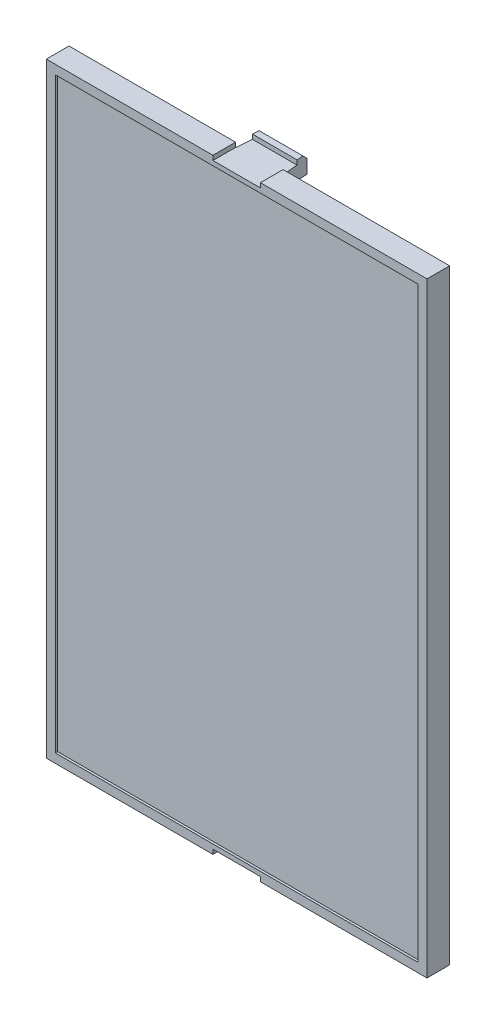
ISO-10303-21;
HEADER;
FILE_DESCRIPTION(('STEP AP214'),'2;1');
FILE_NAME('part.step','',(''),(''),'','','');
FILE_SCHEMA(('AUTOMOTIVE_DESIGN { 1 0 10303 214 1 1 1 1 }'));
ENDSEC;
DATA;
#1=APPLICATION_CONTEXT('core data for automotive mechanical design processes');
#2=APPLICATION_PROTOCOL_DEFINITION('international standard','automotive_design',2000,#1);
#3=PRODUCT_CONTEXT('',#1,'mechanical');
#4=PRODUCT('Part','Part','',(#3));
#5=PRODUCT_RELATED_PRODUCT_CATEGORY('part','',(#4));
#6=PRODUCT_DEFINITION_FORMATION('','',#4);
#7=PRODUCT_DEFINITION_CONTEXT('part definition',#1,'design');
#8=PRODUCT_DEFINITION('design','',#6,#7);
#9=PRODUCT_DEFINITION_SHAPE('','',#8);
#10=(LENGTH_UNIT() NAMED_UNIT(*) SI_UNIT(.MILLI.,.METRE.));
#11=(NAMED_UNIT(*) PLANE_ANGLE_UNIT() SI_UNIT($,.RADIAN.));
#12=(NAMED_UNIT(*) SI_UNIT($,.STERADIAN.) SOLID_ANGLE_UNIT());
#13=UNCERTAINTY_MEASURE_WITH_UNIT(LENGTH_MEASURE(1.E-05),#10,'distance_accuracy_value','');
#14=(GEOMETRIC_REPRESENTATION_CONTEXT(3) GLOBAL_UNCERTAINTY_ASSIGNED_CONTEXT((#13)) GLOBAL_UNIT_ASSIGNED_CONTEXT((#10,
#11,#12)) REPRESENTATION_CONTEXT('',''));
#15=CARTESIAN_POINT('',(0.,0.,0.));
#16=DIRECTION('',(0.,0.,1.));
#17=DIRECTION('',(1.,0.,0.));
#18=AXIS2_PLACEMENT_3D('',#15,#16,#17);
#19=CARTESIAN_POINT('',(-2.495,31.775,-3.825));
#20=DIRECTION('',(-0.996865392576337,0.,-0.0791163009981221));
#21=DIRECTION('',(-0.0791163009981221,0.,0.996865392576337));
#22=AXIS2_PLACEMENT_3D('',#19,#20,#21);
#23=PLANE('',#22);
#24=DIRECTION('',(0.,1.,0.));
#25=VECTOR('',#24,1.);
#26=CARTESIAN_POINT('',(-2.4652380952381,31.775,-4.2));
#27=LINE('',#26,#25);
#28=CARTESIAN_POINT('',(-2.46523809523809,32.9,-4.2));
#29=VERTEX_POINT('',#28);
#30=CARTESIAN_POINT('',(-2.46523809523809,33.4,-4.2));
#31=VERTEX_POINT('',#30);
#32=EDGE_CURVE('E268',#29,#31,#27,.T.);
#33=ORIENTED_EDGE('',*,*,#32,.T.);
#34=DIRECTION('',(-0.0791163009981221,0.,0.996865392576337));
#35=VECTOR('',#34,1.);
#36=CARTESIAN_POINT('',(-2.495,33.4,-3.825));
#37=LINE('',#36,#35);
#38=CARTESIAN_POINT('',(-2.40968253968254,33.4,-4.9));
#39=VERTEX_POINT('',#38);
#40=EDGE_CURVE('E262',#31,#39,#37,.F.);
#41=ORIENTED_EDGE('',*,*,#40,.T.);
#42=DIRECTION('',(0.0560314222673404,-0.70599592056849,-0.705995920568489));
#43=VECTOR('',#42,1.);
#44=CARTESIAN_POINT('',(-2.40968253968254,33.4,-4.9));
#45=LINE('',#44,#43);
#46=CARTESIAN_POINT('',(-2.37,32.9,-5.4));
#47=VERTEX_POINT('',#46);
#48=EDGE_CURVE('E20',#39,#47,#45,.T.);
#49=ORIENTED_EDGE('',*,*,#48,.T.);
#50=DIRECTION('',(0.,1.,0.));
#51=VECTOR('',#50,1.);
#52=CARTESIAN_POINT('',(-2.37,32.15,-5.4));
#53=LINE('',#52,#51);
#54=CARTESIAN_POINT('',(-2.37,31.4,-5.4));
#55=VERTEX_POINT('',#54);
#56=EDGE_CURVE('E335',#55,#47,#53,.T.);
#57=ORIENTED_EDGE('',*,*,#56,.F.);
#58=DIRECTION('',(0.0791163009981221,0.,-0.996865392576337));
#59=VECTOR('',#58,1.);
#60=CARTESIAN_POINT('',(-2.62,31.4,-2.25));
#61=LINE('',#60,#59);
#62=CARTESIAN_POINT('',(-2.62,31.4,-2.25));
#63=VERTEX_POINT('',#62);
#64=EDGE_CURVE('E344',#63,#55,#61,.T.);
#65=ORIENTED_EDGE('',*,*,#64,.F.);
#66=DIRECTION('',(0.,1.,0.));
#67=VECTOR('',#66,1.);
#68=CARTESIAN_POINT('',(-2.62,31.775,-2.25));
#69=LINE('',#68,#67);
#70=CARTESIAN_POINT('',(-2.62,32.4,-2.25));
#71=VERTEX_POINT('',#70);
#72=EDGE_CURVE('E258',#63,#71,#69,.T.);
#73=ORIENTED_EDGE('',*,*,#72,.T.);
#74=DIRECTION('',(-0.0791163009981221,0.,0.996865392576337));
#75=VECTOR('',#74,1.);
#76=CARTESIAN_POINT('',(-2.495,32.4,-3.825));
#77=LINE('',#76,#75);
#78=CARTESIAN_POINT('',(-2.60015873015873,32.4,-2.5));
#79=VERTEX_POINT('',#78);
#80=EDGE_CURVE('E287',#71,#79,#77,.F.);
#81=ORIENTED_EDGE('',*,*,#80,.T.);
#82=DIRECTION('',(0.,1.,0.));
#83=VECTOR('',#82,1.);
#84=CARTESIAN_POINT('',(-2.60015873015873,31.775,-2.5));
#85=LINE('',#84,#83);
#86=CARTESIAN_POINT('',(-2.60015873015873,32.9,-2.5));
#87=VERTEX_POINT('',#86);
#88=EDGE_CURVE('E288',#79,#87,#85,.T.);
#89=ORIENTED_EDGE('',*,*,#88,.T.);
#90=DIRECTION('',(-0.0791163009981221,0.,0.996865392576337));
#91=VECTOR('',#90,1.);
#92=CARTESIAN_POINT('',(-2.495,32.9,-3.825));
#93=LINE('',#92,#91);
#94=EDGE_CURVE('E292',#87,#29,#93,.F.);
#95=ORIENTED_EDGE('',*,*,#94,.T.);
#96=EDGE_LOOP('',(#33,#41,#49,#57,#65,#73,#81,#89,#95));
#97=FACE_BOUND('',#96,.T.);
#98=ADVANCED_FACE('F17',(#97),#23,.T.);
#99=CARTESIAN_POINT('',(2.495,32.525,-3.825));
#100=DIRECTION('',(0.996865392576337,0.,-0.079116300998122));
#101=DIRECTION('',(-0.079116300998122,0.,-0.996865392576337));
#102=AXIS2_PLACEMENT_3D('',#99,#100,#101);
#103=PLANE('',#102);
#104=DIRECTION('',(-0.079116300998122,0.,-0.996865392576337));
#105=VECTOR('',#104,1.);
#106=CARTESIAN_POINT('',(2.495,32.4,-3.825));
#107=LINE('',#106,#105);
#108=CARTESIAN_POINT('',(2.60015873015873,32.4,-2.5));
#109=VERTEX_POINT('',#108);
#110=CARTESIAN_POINT('',(2.62,32.4,-2.25));
#111=VERTEX_POINT('',#110);
#112=EDGE_CURVE('E303',#109,#111,#107,.F.);
#113=ORIENTED_EDGE('',*,*,#112,.T.);
#114=DIRECTION('',(0.,1.,0.));
#115=VECTOR('',#114,1.);
#116=CARTESIAN_POINT('',(2.62,32.525,-2.25));
#117=LINE('',#116,#115);
#118=CARTESIAN_POINT('',(2.62,31.4,-2.25));
#119=VERTEX_POINT('',#118);
#120=EDGE_CURVE('E305',#111,#119,#117,.F.);
#121=ORIENTED_EDGE('',*,*,#120,.T.);
#122=DIRECTION('',(0.0791163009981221,0.,0.996865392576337));
#123=VECTOR('',#122,1.);
#124=CARTESIAN_POINT('',(2.37,31.4,-5.4));
#125=LINE('',#124,#123);
#126=CARTESIAN_POINT('',(2.37,31.4,-5.4));
#127=VERTEX_POINT('',#126);
#128=EDGE_CURVE('E349',#127,#119,#125,.T.);
#129=ORIENTED_EDGE('',*,*,#128,.F.);
#130=DIRECTION('',(0.,1.,0.));
#131=VECTOR('',#130,1.);
#132=CARTESIAN_POINT('',(2.37,32.15,-5.4));
#133=LINE('',#132,#131);
#134=CARTESIAN_POINT('',(2.37,32.9,-5.4));
#135=VERTEX_POINT('',#134);
#136=EDGE_CURVE('E337',#135,#127,#133,.F.);
#137=ORIENTED_EDGE('',*,*,#136,.F.);
#138=DIRECTION('',(0.0560314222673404,0.70599592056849,0.705995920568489));
#139=VECTOR('',#138,1.);
#140=CARTESIAN_POINT('',(2.37,32.9,-5.4));
#141=LINE('',#140,#139);
#142=CARTESIAN_POINT('',(2.40968253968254,33.4,-4.9));
#143=VERTEX_POINT('',#142);
#144=EDGE_CURVE('E272',#135,#143,#141,.T.);
#145=ORIENTED_EDGE('',*,*,#144,.T.);
#146=DIRECTION('',(-0.079116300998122,0.,-0.996865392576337));
#147=VECTOR('',#146,1.);
#148=CARTESIAN_POINT('',(2.495,33.4,-3.825));
#149=LINE('',#148,#147);
#150=CARTESIAN_POINT('',(2.46523809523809,33.4,-4.2));
#151=VERTEX_POINT('',#150);
#152=EDGE_CURVE('E278',#143,#151,#149,.F.);
#153=ORIENTED_EDGE('',*,*,#152,.T.);
#154=DIRECTION('',(0.,1.,0.));
#155=VECTOR('',#154,1.);
#156=CARTESIAN_POINT('',(2.4652380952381,32.525,-4.2));
#157=LINE('',#156,#155);
#158=CARTESIAN_POINT('',(2.46523809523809,32.9,-4.2));
#159=VERTEX_POINT('',#158);
#160=EDGE_CURVE('E297',#151,#159,#157,.F.);
#161=ORIENTED_EDGE('',*,*,#160,.T.);
#162=DIRECTION('',(-0.079116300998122,0.,-0.996865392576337));
#163=VECTOR('',#162,1.);
#164=CARTESIAN_POINT('',(2.495,32.9,-3.825));
#165=LINE('',#164,#163);
#166=CARTESIAN_POINT('',(2.60015873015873,32.9,-2.5));
#167=VERTEX_POINT('',#166);
#168=EDGE_CURVE('E299',#159,#167,#165,.F.);
#169=ORIENTED_EDGE('',*,*,#168,.T.);
#170=DIRECTION('',(0.,1.,0.));
#171=VECTOR('',#170,1.);
#172=CARTESIAN_POINT('',(2.60015873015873,32.525,-2.5));
#173=LINE('',#172,#171);
#174=EDGE_CURVE('E301',#167,#109,#173,.F.);
#175=ORIENTED_EDGE('',*,*,#174,.T.);
#176=EDGE_LOOP('',(#113,#121,#129,#137,#145,#153,#161,#169,#175));
#177=FACE_BOUND('',#176,.T.);
#178=ADVANCED_FACE('F703',(#177),#103,.T.);
#179=CARTESIAN_POINT('',(-2.49500000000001,-32.525,-3.825));
#180=DIRECTION('',(-0.996865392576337,0.,-0.0791163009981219));
#181=DIRECTION('',(-0.0791163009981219,0.,0.996865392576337));
#182=AXIS2_PLACEMENT_3D('',#179,#180,#181);
#183=PLANE('',#182);
#184=DIRECTION('',(-0.0791163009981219,0.,0.996865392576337));
#185=VECTOR('',#184,1.);
#186=CARTESIAN_POINT('',(-2.49500000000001,-32.4,-3.825));
#187=LINE('',#186,#185);
#188=CARTESIAN_POINT('',(-2.60015873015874,-32.4,-2.5));
#189=VERTEX_POINT('',#188);
#190=CARTESIAN_POINT('',(-2.62000000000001,-32.4,-2.25));
#191=VERTEX_POINT('',#190);
#192=EDGE_CURVE('E317',#189,#191,#187,.T.);
#193=ORIENTED_EDGE('',*,*,#192,.T.);
#194=DIRECTION('',(0.,1.,0.));
#195=VECTOR('',#194,1.);
#196=CARTESIAN_POINT('',(-2.62000000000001,-32.525,-2.25));
#197=LINE('',#196,#195);
#198=CARTESIAN_POINT('',(-2.62000000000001,-31.4,-2.25));
#199=VERTEX_POINT('',#198);
#200=EDGE_CURVE('E319',#191,#199,#197,.T.);
#201=ORIENTED_EDGE('',*,*,#200,.T.);
#202=DIRECTION('',(-0.0791163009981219,0.,0.996865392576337));
#203=VECTOR('',#202,1.);
#204=CARTESIAN_POINT('',(-2.37000000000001,-31.4,-5.4));
#205=LINE('',#204,#203);
#206=CARTESIAN_POINT('',(-2.37000000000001,-31.4,-5.4));
#207=VERTEX_POINT('',#206);
#208=EDGE_CURVE('E352',#207,#199,#205,.T.);
#209=ORIENTED_EDGE('',*,*,#208,.F.);
#210=DIRECTION('',(0.,1.,0.));
#211=VECTOR('',#210,1.);
#212=CARTESIAN_POINT('',(-2.37000000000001,-32.15,-5.4));
#213=LINE('',#212,#211);
#214=CARTESIAN_POINT('',(-2.37000000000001,-32.9,-5.4));
#215=VERTEX_POINT('',#214);
#216=EDGE_CURVE('E339',#215,#207,#213,.T.);
#217=ORIENTED_EDGE('',*,*,#216,.F.);
#218=DIRECTION('',(-0.0560314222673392,-0.705995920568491,0.705995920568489));
#219=VECTOR('',#218,1.);
#220=CARTESIAN_POINT('',(-2.37000000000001,-32.9,-5.4));
#221=LINE('',#220,#219);
#222=CARTESIAN_POINT('',(-2.40968253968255,-33.4,-4.9));
#223=VERTEX_POINT('',#222);
#224=EDGE_CURVE('E307',#215,#223,#221,.T.);
#225=ORIENTED_EDGE('',*,*,#224,.T.);
#226=DIRECTION('',(-0.0791163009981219,0.,0.996865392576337));
#227=VECTOR('',#226,1.);
#228=CARTESIAN_POINT('',(-2.49500000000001,-33.4,-3.825));
#229=LINE('',#228,#227);
#230=CARTESIAN_POINT('',(-2.4652380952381,-33.4,-4.2));
#231=VERTEX_POINT('',#230);
#232=EDGE_CURVE('E309',#223,#231,#229,.T.);
#233=ORIENTED_EDGE('',*,*,#232,.T.);
#234=DIRECTION('',(0.,1.,0.));
#235=VECTOR('',#234,1.);
#236=CARTESIAN_POINT('',(-2.4652380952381,-32.525,-4.2));
#237=LINE('',#236,#235);
#238=CARTESIAN_POINT('',(-2.4652380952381,-32.9,-4.2));
#239=VERTEX_POINT('',#238);
#240=EDGE_CURVE('E311',#231,#239,#237,.T.);
#241=ORIENTED_EDGE('',*,*,#240,.T.);
#242=DIRECTION('',(-0.0791163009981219,0.,0.996865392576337));
#243=VECTOR('',#242,1.);
#244=CARTESIAN_POINT('',(-2.49500000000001,-32.9,-3.825));
#245=LINE('',#244,#243);
#246=CARTESIAN_POINT('',(-2.60015873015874,-32.9,-2.5));
#247=VERTEX_POINT('',#246);
#248=EDGE_CURVE('E313',#239,#247,#245,.T.);
#249=ORIENTED_EDGE('',*,*,#248,.T.);
#250=DIRECTION('',(0.,1.,0.));
#251=VECTOR('',#250,1.);
#252=CARTESIAN_POINT('',(-2.60015873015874,-32.525,-2.5));
#253=LINE('',#252,#251);
#254=EDGE_CURVE('E315',#247,#189,#253,.T.);
#255=ORIENTED_EDGE('',*,*,#254,.T.);
#256=EDGE_LOOP('',(#193,#201,#209,#217,#225,#233,#241,#249,#255));
#257=FACE_BOUND('',#256,.T.);
#258=ADVANCED_FACE('F700',(#257),#183,.T.);
#259=CARTESIAN_POINT('',(2.49499999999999,-31.775,-3.825));
#260=DIRECTION('',(0.996865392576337,0.,-0.079116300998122));
#261=DIRECTION('',(-0.079116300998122,0.,-0.996865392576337));
#262=AXIS2_PLACEMENT_3D('',#259,#260,#261);
#263=PLANE('',#262);
#264=DIRECTION('',(0.,1.,0.));
#265=VECTOR('',#264,1.);
#266=CARTESIAN_POINT('',(2.46523809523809,-31.775,-4.2));
#267=LINE('',#266,#265);
#268=CARTESIAN_POINT('',(2.46523809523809,-32.9,-4.2));
#269=VERTEX_POINT('',#268);
#270=CARTESIAN_POINT('',(2.46523809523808,-33.4,-4.2));
#271=VERTEX_POINT('',#270);
#272=EDGE_CURVE('E331',#269,#271,#267,.F.);
#273=ORIENTED_EDGE('',*,*,#272,.T.);
#274=DIRECTION('',(-0.079116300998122,0.,-0.996865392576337));
#275=VECTOR('',#274,1.);
#276=CARTESIAN_POINT('',(2.49499999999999,-33.4,-3.825));
#277=LINE('',#276,#275);
#278=CARTESIAN_POINT('',(2.40968253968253,-33.4,-4.9));
#279=VERTEX_POINT('',#278);
#280=EDGE_CURVE('E333',#271,#279,#277,.T.);
#281=ORIENTED_EDGE('',*,*,#280,.T.);
#282=DIRECTION('',(-0.0560314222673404,0.70599592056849,-0.705995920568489));
#283=VECTOR('',#282,1.);
#284=CARTESIAN_POINT('',(2.40968253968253,-33.4,-4.9));
#285=LINE('',#284,#283);
#286=CARTESIAN_POINT('',(2.36999999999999,-32.9,-5.4));
#287=VERTEX_POINT('',#286);
#288=EDGE_CURVE('E321',#279,#287,#285,.T.);
#289=ORIENTED_EDGE('',*,*,#288,.T.);
#290=DIRECTION('',(0.,1.,0.));
#291=VECTOR('',#290,1.);
#292=CARTESIAN_POINT('',(2.36999999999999,-32.15,-5.4));
#293=LINE('',#292,#291);
#294=CARTESIAN_POINT('',(2.36999999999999,-31.4,-5.4));
#295=VERTEX_POINT('',#294);
#296=EDGE_CURVE('E341',#295,#287,#293,.F.);
#297=ORIENTED_EDGE('',*,*,#296,.F.);
#298=DIRECTION('',(-0.0791163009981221,0.,-0.996865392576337));
#299=VECTOR('',#298,1.);
#300=CARTESIAN_POINT('',(2.61999999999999,-31.4,-2.25));
#301=LINE('',#300,#299);
#302=CARTESIAN_POINT('',(2.61999999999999,-31.4,-2.25));
#303=VERTEX_POINT('',#302);
#304=EDGE_CURVE('E355',#303,#295,#301,.T.);
#305=ORIENTED_EDGE('',*,*,#304,.F.);
#306=DIRECTION('',(0.,1.,0.));
#307=VECTOR('',#306,1.);
#308=CARTESIAN_POINT('',(2.61999999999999,-31.775,-2.25));
#309=LINE('',#308,#307);
#310=CARTESIAN_POINT('',(2.61999999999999,-32.4,-2.25));
#311=VERTEX_POINT('',#310);
#312=EDGE_CURVE('E323',#303,#311,#309,.F.);
#313=ORIENTED_EDGE('',*,*,#312,.T.);
#314=DIRECTION('',(-0.079116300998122,0.,-0.996865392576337));
#315=VECTOR('',#314,1.);
#316=CARTESIAN_POINT('',(2.49499999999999,-32.4,-3.825));
#317=LINE('',#316,#315);
#318=CARTESIAN_POINT('',(2.60015873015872,-32.4,-2.5));
#319=VERTEX_POINT('',#318);
#320=EDGE_CURVE('E325',#311,#319,#317,.T.);
#321=ORIENTED_EDGE('',*,*,#320,.T.);
#322=DIRECTION('',(0.,1.,0.));
#323=VECTOR('',#322,1.);
#324=CARTESIAN_POINT('',(2.60015873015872,-31.775,-2.5));
#325=LINE('',#324,#323);
#326=CARTESIAN_POINT('',(2.60015873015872,-32.9,-2.5));
#327=VERTEX_POINT('',#326);
#328=EDGE_CURVE('E327',#319,#327,#325,.F.);
#329=ORIENTED_EDGE('',*,*,#328,.T.);
#330=DIRECTION('',(-0.079116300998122,0.,-0.996865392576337));
#331=VECTOR('',#330,1.);
#332=CARTESIAN_POINT('',(2.49499999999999,-32.9,-3.825));
#333=LINE('',#332,#331);
#334=EDGE_CURVE('E329',#327,#269,#333,.T.);
#335=ORIENTED_EDGE('',*,*,#334,.T.);
#336=EDGE_LOOP('',(#273,#281,#289,#297,#305,#313,#321,#329,#335));
#337=FACE_BOUND('',#336,.T.);
#338=ADVANCED_FACE('F696',(#337),#263,.T.);
#339=CARTESIAN_POINT('',(0.,32.15,-5.4));
#340=DIRECTION('',(0.,0.,-1.));
#341=DIRECTION('',(-1.,0.,0.));
#342=AXIS2_PLACEMENT_3D('',#339,#340,#341);
#343=PLANE('',#342);
#344=ORIENTED_EDGE('',*,*,#136,.T.);
#345=DIRECTION('',(1.,0.,0.));
#346=VECTOR('',#345,1.);
#347=CARTESIAN_POINT('',(2.62,31.4,-5.4));
#348=LINE('',#347,#346);
#349=EDGE_CURVE('E346',#55,#127,#348,.T.);
#350=ORIENTED_EDGE('',*,*,#349,.F.);
#351=ORIENTED_EDGE('',*,*,#56,.T.);
#352=DIRECTION('',(1.,0.,0.));
#353=VECTOR('',#352,1.);
#354=CARTESIAN_POINT('',(-1.31000000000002,32.9,-5.4));
#355=LINE('',#354,#353);
#356=EDGE_CURVE('E286',#135,#47,#355,.F.);
#357=ORIENTED_EDGE('',*,*,#356,.F.);
#358=EDGE_LOOP('',(#344,#350,#351,#357));
#359=FACE_BOUND('',#358,.T.);
#360=ADVANCED_FACE('F692',(#359),#343,.T.);
#361=CARTESIAN_POINT('',(0.,-32.15,-5.4));
#362=DIRECTION('',(0.,0.,-1.));
#363=DIRECTION('',(-1.,0.,0.));
#364=AXIS2_PLACEMENT_3D('',#361,#362,#363);
#365=PLANE('',#364);
#366=ORIENTED_EDGE('',*,*,#296,.T.);
#367=DIRECTION('',(1.,0.,0.));
#368=VECTOR('',#367,1.);
#369=CARTESIAN_POINT('',(-1.31000000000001,-32.9,-5.4));
#370=LINE('',#369,#368);
#371=EDGE_CURVE('E361',#215,#287,#370,.T.);
#372=ORIENTED_EDGE('',*,*,#371,.F.);
#373=ORIENTED_EDGE('',*,*,#216,.T.);
#374=DIRECTION('',(1.,0.,0.));
#375=VECTOR('',#374,1.);
#376=CARTESIAN_POINT('',(-2.62000000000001,-31.4,-5.4));
#377=LINE('',#376,#375);
#378=EDGE_CURVE('E357',#295,#207,#377,.F.);
#379=ORIENTED_EDGE('',*,*,#378,.F.);
#380=EDGE_LOOP('',(#366,#372,#373,#379));
#381=FACE_BOUND('',#380,.T.);
#382=ADVANCED_FACE('F688',(#381),#365,.T.);
#383=CARTESIAN_POINT('',(2.62,31.4,-2.25));
#384=DIRECTION('',(0.,-1.,0.));
#385=DIRECTION('',(0.,0.,-1.));
#386=AXIS2_PLACEMENT_3D('',#383,#384,#385);
#387=PLANE('',#386);
#388=ORIENTED_EDGE('',*,*,#128,.T.);
#389=DIRECTION('',(1.,0.,0.));
#390=VECTOR('',#389,1.);
#391=CARTESIAN_POINT('',(0.,31.4,-2.25));
#392=LINE('',#391,#390);
#393=EDGE_CURVE('E364',#119,#63,#392,.F.);
#394=ORIENTED_EDGE('',*,*,#393,.T.);
#395=ORIENTED_EDGE('',*,*,#64,.T.);
#396=ORIENTED_EDGE('',*,*,#349,.T.);
#397=EDGE_LOOP('',(#388,#394,#395,#396));
#398=FACE_BOUND('',#397,.T.);
#399=ADVANCED_FACE('F684',(#398),#387,.T.);
#400=CARTESIAN_POINT('',(-2.62000000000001,-31.4,-2.25));
#401=DIRECTION('',(0.,1.,0.));
#402=DIRECTION('',(0.,0.,1.));
#403=AXIS2_PLACEMENT_3D('',#400,#401,#402);
#404=PLANE('',#403);
#405=ORIENTED_EDGE('',*,*,#304,.T.);
#406=ORIENTED_EDGE('',*,*,#378,.T.);
#407=ORIENTED_EDGE('',*,*,#208,.T.);
#408=DIRECTION('',(1.,0.,0.));
#409=VECTOR('',#408,1.);
#410=CARTESIAN_POINT('',(0.,-31.4,-2.25));
#411=LINE('',#410,#409);
#412=EDGE_CURVE('E281',#199,#303,#411,.T.);
#413=ORIENTED_EDGE('',*,*,#412,.T.);
#414=EDGE_LOOP('',(#405,#406,#407,#413));
#415=FACE_BOUND('',#414,.T.);
#416=ADVANCED_FACE('F681',(#415),#404,.T.);
#417=CARTESIAN_POINT('',(-1.31000000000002,33.15,-5.15));
#418=DIRECTION('',(0.,0.707106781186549,-0.707106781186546));
#419=DIRECTION('',(0.,0.707106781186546,0.707106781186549));
#420=AXIS2_PLACEMENT_3D('',#417,#418,#419);
#421=PLANE('',#420);
#422=ORIENTED_EDGE('',*,*,#144,.F.);
#423=ORIENTED_EDGE('',*,*,#356,.T.);
#424=ORIENTED_EDGE('',*,*,#48,.F.);
#425=DIRECTION('',(-1.,0.,0.));
#426=VECTOR('',#425,1.);
#427=CARTESIAN_POINT('',(-2.62000000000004,33.4,-4.9));
#428=LINE('',#427,#426);
#429=EDGE_CURVE('E276',#143,#39,#428,.T.);
#430=ORIENTED_EDGE('',*,*,#429,.F.);
#431=EDGE_LOOP('',(#422,#423,#424,#430));
#432=FACE_BOUND('',#431,.T.);
#433=ADVANCED_FACE('F284',(#432),#421,.T.);
#434=CARTESIAN_POINT('',(-1.31000000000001,-33.15,-5.15));
#435=DIRECTION('',(0.,-0.707106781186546,-0.707106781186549));
#436=DIRECTION('',(0.,0.707106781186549,-0.707106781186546));
#437=AXIS2_PLACEMENT_3D('',#434,#435,#436);
#438=PLANE('',#437);
#439=ORIENTED_EDGE('',*,*,#288,.F.);
#440=DIRECTION('',(1.,0.,0.));
#441=VECTOR('',#440,1.);
#442=CARTESIAN_POINT('',(-2.62000000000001,-33.4,-4.9));
#443=LINE('',#442,#441);
#444=EDGE_CURVE('E382',#223,#279,#443,.T.);
#445=ORIENTED_EDGE('',*,*,#444,.F.);
#446=ORIENTED_EDGE('',*,*,#224,.F.);
#447=ORIENTED_EDGE('',*,*,#371,.T.);
#448=EDGE_LOOP('',(#439,#445,#446,#447));
#449=FACE_BOUND('',#448,.T.);
#450=ADVANCED_FACE('F674',(#449),#438,.T.);
#451=CARTESIAN_POINT('',(0.,0.,-2.25));
#452=DIRECTION('',(0.,0.,1.));
#453=DIRECTION('',(1.,0.,0.));
#454=AXIS2_PLACEMENT_3D('',#451,#452,#453);
#455=PLANE('',#454);
#456=DIRECTION('',(1.,0.,0.));
#457=VECTOR('',#456,1.);
#458=CARTESIAN_POINT('',(20.,32.4,-2.25));
#459=LINE('',#458,#457);
#460=CARTESIAN_POINT('',(20.,32.4,-2.25));
#461=VERTEX_POINT('',#460);
#462=EDGE_CURVE('E394',#111,#461,#459,.T.);
#463=ORIENTED_EDGE('',*,*,#462,.T.);
#464=DIRECTION('',(0.,1.,0.));
#465=VECTOR('',#464,1.);
#466=CARTESIAN_POINT('',(20.,-38.65,-2.25));
#467=LINE('',#466,#465);
#468=CARTESIAN_POINT('',(20.,-32.4,-2.25));
#469=VERTEX_POINT('',#468);
#470=EDGE_CURVE('E388',#461,#469,#467,.F.);
#471=ORIENTED_EDGE('',*,*,#470,.T.);
#472=DIRECTION('',(1.,0.,0.));
#473=VECTOR('',#472,1.);
#474=CARTESIAN_POINT('',(-20.,-32.4,-2.25));
#475=LINE('',#474,#473);
#476=EDGE_CURVE('E385',#469,#311,#475,.F.);
#477=ORIENTED_EDGE('',*,*,#476,.T.);
#478=ORIENTED_EDGE('',*,*,#312,.F.);
#479=ORIENTED_EDGE('',*,*,#412,.F.);
#480=ORIENTED_EDGE('',*,*,#200,.F.);
#481=DIRECTION('',(1.,0.,0.));
#482=VECTOR('',#481,1.);
#483=CARTESIAN_POINT('',(-20.,-32.4,-2.25));
#484=LINE('',#483,#482);
#485=CARTESIAN_POINT('',(-20.,-32.4,-2.25));
#486=VERTEX_POINT('',#485);
#487=EDGE_CURVE('E376',#191,#486,#484,.F.);
#488=ORIENTED_EDGE('',*,*,#487,.T.);
#489=DIRECTION('',(0.,1.,0.));
#490=VECTOR('',#489,1.);
#491=CARTESIAN_POINT('',(-20.,38.65,-2.25));
#492=LINE('',#491,#490);
#493=CARTESIAN_POINT('',(-20.,32.4,-2.25));
#494=VERTEX_POINT('',#493);
#495=EDGE_CURVE('E370',#486,#494,#492,.T.);
#496=ORIENTED_EDGE('',*,*,#495,.T.);
#497=DIRECTION('',(1.,0.,0.));
#498=VECTOR('',#497,1.);
#499=CARTESIAN_POINT('',(20.,32.4,-2.25));
#500=LINE('',#499,#498);
#501=EDGE_CURVE('E280',#494,#71,#500,.T.);
#502=ORIENTED_EDGE('',*,*,#501,.T.);
#503=ORIENTED_EDGE('',*,*,#72,.F.);
#504=ORIENTED_EDGE('',*,*,#393,.F.);
#505=ORIENTED_EDGE('',*,*,#120,.F.);
#506=EDGE_LOOP('',(#463,#471,#477,#478,#479,#480,#488,#496,#502,#503,#504,#505));
#507=FACE_BOUND('',#506,.T.);
#508=ADVANCED_FACE('F671',(#507),#455,.F.);
#509=CARTESIAN_POINT('',(-2.62000000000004,33.4,-5.4));
#510=DIRECTION('',(0.,1.,0.));
#511=DIRECTION('',(-1.,0.,0.));
#512=AXIS2_PLACEMENT_3D('',#509,#510,#511);
#513=PLANE('',#512);
#514=ORIENTED_EDGE('',*,*,#152,.F.);
#515=ORIENTED_EDGE('',*,*,#429,.T.);
#516=ORIENTED_EDGE('',*,*,#40,.F.);
#517=DIRECTION('',(1.,0.,0.));
#518=VECTOR('',#517,1.);
#519=CARTESIAN_POINT('',(-2.62000000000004,33.4,-4.2));
#520=LINE('',#519,#518);
#521=EDGE_CURVE('E402',#151,#31,#520,.F.);
#522=ORIENTED_EDGE('',*,*,#521,.F.);
#523=EDGE_LOOP('',(#514,#515,#516,#522));
#524=FACE_BOUND('',#523,.T.);
#525=ADVANCED_FACE('F277',(#524),#513,.T.);
#526=CARTESIAN_POINT('',(20.,32.4,-2.5));
#527=DIRECTION('',(0.,1.,0.));
#528=DIRECTION('',(0.,0.,1.));
#529=AXIS2_PLACEMENT_3D('',#526,#527,#528);
#530=PLANE('',#529);
#531=DIRECTION('',(0.,0.,1.));
#532=VECTOR('',#531,1.);
#533=CARTESIAN_POINT('',(-20.,32.4,-2.5));
#534=LINE('',#533,#532);
#535=CARTESIAN_POINT('',(-20.,32.4,-2.5));
#536=VERTEX_POINT('',#535);
#537=EDGE_CURVE('E373',#494,#536,#534,.F.);
#538=ORIENTED_EDGE('',*,*,#537,.T.);
#539=DIRECTION('',(-1.,0.,0.));
#540=VECTOR('',#539,1.);
#541=CARTESIAN_POINT('',(0.,32.4,-2.5));
#542=LINE('',#541,#540);
#543=EDGE_CURVE('E406',#79,#536,#542,.T.);
#544=ORIENTED_EDGE('',*,*,#543,.F.);
#545=ORIENTED_EDGE('',*,*,#80,.F.);
#546=ORIENTED_EDGE('',*,*,#501,.F.);
#547=EDGE_LOOP('',(#538,#544,#545,#546));
#548=FACE_BOUND('',#547,.T.);
#549=ADVANCED_FACE('F664',(#548),#530,.F.);
#550=CARTESIAN_POINT('',(-20.,38.65,-2.5));
#551=DIRECTION('',(-1.,0.,0.));
#552=DIRECTION('',(0.,0.,1.));
#553=AXIS2_PLACEMENT_3D('',#550,#551,#552);
#554=PLANE('',#553);
#555=ORIENTED_EDGE('',*,*,#537,.F.);
#556=ORIENTED_EDGE('',*,*,#495,.F.);
#557=DIRECTION('',(0.,0.,-1.));
#558=VECTOR('',#557,1.);
#559=CARTESIAN_POINT('',(-20.,-32.4,-2.5));
#560=LINE('',#559,#558);
#561=CARTESIAN_POINT('',(-20.,-32.4,-2.5));
#562=VERTEX_POINT('',#561);
#563=EDGE_CURVE('E379',#486,#562,#560,.T.);
#564=ORIENTED_EDGE('',*,*,#563,.T.);
#565=DIRECTION('',(0.,1.,0.));
#566=VECTOR('',#565,1.);
#567=CARTESIAN_POINT('',(-20.,0.,-2.5));
#568=LINE('',#567,#566);
#569=EDGE_CURVE('E408',#536,#562,#568,.F.);
#570=ORIENTED_EDGE('',*,*,#569,.F.);
#571=EDGE_LOOP('',(#555,#556,#564,#570));
#572=FACE_BOUND('',#571,.T.);
#573=ADVANCED_FACE('F660',(#572),#554,.F.);
#574=CARTESIAN_POINT('',(-20.,-32.4,-2.5));
#575=DIRECTION('',(0.,-1.,0.));
#576=DIRECTION('',(0.,0.,-1.));
#577=AXIS2_PLACEMENT_3D('',#574,#575,#576);
#578=PLANE('',#577);
#579=ORIENTED_EDGE('',*,*,#563,.F.);
#580=ORIENTED_EDGE('',*,*,#487,.F.);
#581=ORIENTED_EDGE('',*,*,#192,.F.);
#582=DIRECTION('',(-1.,0.,0.));
#583=VECTOR('',#582,1.);
#584=CARTESIAN_POINT('',(0.,-32.4,-2.5));
#585=LINE('',#584,#583);
#586=EDGE_CURVE('E410',#562,#189,#585,.F.);
#587=ORIENTED_EDGE('',*,*,#586,.F.);
#588=EDGE_LOOP('',(#579,#580,#581,#587));
#589=FACE_BOUND('',#588,.T.);
#590=ADVANCED_FACE('F656',(#589),#578,.F.);
#591=CARTESIAN_POINT('',(-2.62000000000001,-33.4,-4.2));
#592=DIRECTION('',(0.,-1.,0.));
#593=DIRECTION('',(1.,0.,0.));
#594=AXIS2_PLACEMENT_3D('',#591,#592,#593);
#595=PLANE('',#594);
#596=ORIENTED_EDGE('',*,*,#280,.F.);
#597=DIRECTION('',(1.,0.,0.));
#598=VECTOR('',#597,1.);
#599=CARTESIAN_POINT('',(-2.62000000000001,-33.4,-4.2));
#600=LINE('',#599,#598);
#601=EDGE_CURVE('E417',#231,#271,#600,.T.);
#602=ORIENTED_EDGE('',*,*,#601,.F.);
#603=ORIENTED_EDGE('',*,*,#232,.F.);
#604=ORIENTED_EDGE('',*,*,#444,.T.);
#605=EDGE_LOOP('',(#596,#602,#603,#604));
#606=FACE_BOUND('',#605,.T.);
#607=ADVANCED_FACE('F652',(#606),#595,.T.);
#608=CARTESIAN_POINT('',(-20.,-32.4,-2.5));
#609=DIRECTION('',(0.,-1.,0.));
#610=DIRECTION('',(0.,0.,-1.));
#611=AXIS2_PLACEMENT_3D('',#608,#609,#610);
#612=PLANE('',#611);
#613=DIRECTION('',(0.,0.,-1.));
#614=VECTOR('',#613,1.);
#615=CARTESIAN_POINT('',(20.,-32.4,-2.5));
#616=LINE('',#615,#614);
#617=CARTESIAN_POINT('',(20.,-32.4,-2.5));
#618=VERTEX_POINT('',#617);
#619=EDGE_CURVE('E391',#469,#618,#616,.T.);
#620=ORIENTED_EDGE('',*,*,#619,.T.);
#621=DIRECTION('',(-1.,0.,0.));
#622=VECTOR('',#621,1.);
#623=CARTESIAN_POINT('',(0.,-32.4,-2.5));
#624=LINE('',#623,#622);
#625=EDGE_CURVE('E431',#319,#618,#624,.F.);
#626=ORIENTED_EDGE('',*,*,#625,.F.);
#627=ORIENTED_EDGE('',*,*,#320,.F.);
#628=ORIENTED_EDGE('',*,*,#476,.F.);
#629=EDGE_LOOP('',(#620,#626,#627,#628));
#630=FACE_BOUND('',#629,.T.);
#631=ADVANCED_FACE('F648',(#630),#612,.F.);
#632=CARTESIAN_POINT('',(20.,-38.65,-2.5));
#633=DIRECTION('',(1.,0.,0.));
#634=DIRECTION('',(0.,0.,-1.));
#635=AXIS2_PLACEMENT_3D('',#632,#633,#634);
#636=PLANE('',#635);
#637=ORIENTED_EDGE('',*,*,#619,.F.);
#638=ORIENTED_EDGE('',*,*,#470,.F.);
#639=DIRECTION('',(0.,0.,1.));
#640=VECTOR('',#639,1.);
#641=CARTESIAN_POINT('',(20.,32.4,-2.5));
#642=LINE('',#641,#640);
#643=CARTESIAN_POINT('',(20.,32.4,-2.5));
#644=VERTEX_POINT('',#643);
#645=EDGE_CURVE('E397',#461,#644,#642,.F.);
#646=ORIENTED_EDGE('',*,*,#645,.T.);
#647=DIRECTION('',(0.,1.,0.));
#648=VECTOR('',#647,1.);
#649=CARTESIAN_POINT('',(20.,0.,-2.5));
#650=LINE('',#649,#648);
#651=EDGE_CURVE('E433',#618,#644,#650,.T.);
#652=ORIENTED_EDGE('',*,*,#651,.F.);
#653=EDGE_LOOP('',(#637,#638,#646,#652));
#654=FACE_BOUND('',#653,.T.);
#655=ADVANCED_FACE('F644',(#654),#636,.F.);
#656=CARTESIAN_POINT('',(20.,32.4,-2.5));
#657=DIRECTION('',(0.,1.,0.));
#658=DIRECTION('',(0.,0.,1.));
#659=AXIS2_PLACEMENT_3D('',#656,#657,#658);
#660=PLANE('',#659);
#661=ORIENTED_EDGE('',*,*,#645,.F.);
#662=ORIENTED_EDGE('',*,*,#462,.F.);
#663=ORIENTED_EDGE('',*,*,#112,.F.);
#664=DIRECTION('',(-1.,0.,0.));
#665=VECTOR('',#664,1.);
#666=CARTESIAN_POINT('',(0.,32.4,-2.5));
#667=LINE('',#666,#665);
#668=EDGE_CURVE('E435',#644,#109,#667,.T.);
#669=ORIENTED_EDGE('',*,*,#668,.F.);
#670=EDGE_LOOP('',(#661,#662,#663,#669));
#671=FACE_BOUND('',#670,.T.);
#672=ADVANCED_FACE('F640',(#671),#660,.F.);
#673=CARTESIAN_POINT('',(2.62,32.9,0.));
#674=DIRECTION('',(-1.,0.,0.));
#675=DIRECTION('',(0.,0.,1.));
#676=AXIS2_PLACEMENT_3D('',#673,#674,#675);
#677=PLANE('',#676);
#678=DIRECTION('',(0.,1.,0.));
#679=VECTOR('',#678,1.);
#680=CARTESIAN_POINT('',(2.62,0.,-2.5));
#681=LINE('',#680,#679);
#682=CARTESIAN_POINT('',(2.62,32.9,-2.5));
#683=VERTEX_POINT('',#682);
#684=CARTESIAN_POINT('',(2.62,33.4,-2.5));
#685=VERTEX_POINT('',#684);
#686=EDGE_CURVE('E427',#683,#685,#681,.T.);
#687=ORIENTED_EDGE('',*,*,#686,.F.);
#688=DIRECTION('',(0.,0.,1.));
#689=VECTOR('',#688,1.);
#690=CARTESIAN_POINT('',(2.62,32.9,0.));
#691=LINE('',#690,#689);
#692=CARTESIAN_POINT('',(2.62,32.9,0.));
#693=VERTEX_POINT('',#692);
#694=EDGE_CURVE('E450',#693,#683,#691,.F.);
#695=ORIENTED_EDGE('',*,*,#694,.F.);
#696=DIRECTION('',(0.,1.,0.));
#697=VECTOR('',#696,1.);
#698=CARTESIAN_POINT('',(2.62,32.9,0.));
#699=LINE('',#698,#697);
#700=CARTESIAN_POINT('',(2.62,33.4,0.));
#701=VERTEX_POINT('',#700);
#702=EDGE_CURVE('E400',#693,#701,#699,.T.);
#703=ORIENTED_EDGE('',*,*,#702,.T.);
#704=DIRECTION('',(0.,0.,1.));
#705=VECTOR('',#704,1.);
#706=CARTESIAN_POINT('',(2.62,33.4,0.));
#707=LINE('',#706,#705);
#708=EDGE_CURVE('E441',#685,#701,#707,.T.);
#709=ORIENTED_EDGE('',*,*,#708,.F.);
#710=EDGE_LOOP('',(#687,#695,#703,#709));
#711=FACE_BOUND('',#710,.T.);
#712=ADVANCED_FACE('F636',(#711),#677,.T.);
#713=CARTESIAN_POINT('',(-2.62000000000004,33.4,-4.2));
#714=DIRECTION('',(0.,0.,1.));
#715=DIRECTION('',(1.,0.,0.));
#716=AXIS2_PLACEMENT_3D('',#713,#714,#715);
#717=PLANE('',#716);
#718=ORIENTED_EDGE('',*,*,#160,.F.);
#719=ORIENTED_EDGE('',*,*,#521,.T.);
#720=ORIENTED_EDGE('',*,*,#32,.F.);
#721=DIRECTION('',(1.,0.,0.));
#722=VECTOR('',#721,1.);
#723=CARTESIAN_POINT('',(-2.62,32.9,-4.2));
#724=LINE('',#723,#722);
#725=EDGE_CURVE('E455',#159,#29,#724,.F.);
#726=ORIENTED_EDGE('',*,*,#725,.F.);
#727=EDGE_LOOP('',(#718,#719,#720,#726));
#728=FACE_BOUND('',#727,.T.);
#729=ADVANCED_FACE('F632',(#728),#717,.T.);
#730=CARTESIAN_POINT('',(-2.62,33.4,0.));
#731=DIRECTION('',(1.,0.,0.));
#732=DIRECTION('',(0.,0.,-1.));
#733=AXIS2_PLACEMENT_3D('',#730,#731,#732);
#734=PLANE('',#733);
#735=DIRECTION('',(0.,1.,0.));
#736=VECTOR('',#735,1.);
#737=CARTESIAN_POINT('',(-2.62,0.,-2.5));
#738=LINE('',#737,#736);
#739=CARTESIAN_POINT('',(-2.62,33.4,-2.5));
#740=VERTEX_POINT('',#739);
#741=CARTESIAN_POINT('',(-2.62,32.9,-2.5));
#742=VERTEX_POINT('',#741);
#743=EDGE_CURVE('E415',#740,#742,#738,.F.);
#744=ORIENTED_EDGE('',*,*,#743,.F.);
#745=DIRECTION('',(0.,0.,1.));
#746=VECTOR('',#745,1.);
#747=CARTESIAN_POINT('',(-2.62,33.4,0.));
#748=LINE('',#747,#746);
#749=CARTESIAN_POINT('',(-2.62,33.4,0.));
#750=VERTEX_POINT('',#749);
#751=EDGE_CURVE('E458',#750,#740,#748,.F.);
#752=ORIENTED_EDGE('',*,*,#751,.F.);
#753=DIRECTION('',(0.,1.,0.));
#754=VECTOR('',#753,1.);
#755=CARTESIAN_POINT('',(-2.62,33.4,0.));
#756=LINE('',#755,#754);
#757=CARTESIAN_POINT('',(-2.62,32.9,0.));
#758=VERTEX_POINT('',#757);
#759=EDGE_CURVE('E404',#750,#758,#756,.F.);
#760=ORIENTED_EDGE('',*,*,#759,.T.);
#761=DIRECTION('',(0.,0.,1.));
#762=VECTOR('',#761,1.);
#763=CARTESIAN_POINT('',(-2.62,32.9,0.));
#764=LINE('',#763,#762);
#765=EDGE_CURVE('E447',#742,#758,#764,.T.);
#766=ORIENTED_EDGE('',*,*,#765,.F.);
#767=EDGE_LOOP('',(#744,#752,#760,#766));
#768=FACE_BOUND('',#767,.T.);
#769=ADVANCED_FACE('F628',(#768),#734,.T.);
#770=CARTESIAN_POINT('',(0.,0.,-2.5));
#771=DIRECTION('',(0.,0.,-1.));
#772=DIRECTION('',(-1.,0.,0.));
#773=AXIS2_PLACEMENT_3D('',#770,#771,#772);
#774=PLANE('',#773);
#775=DIRECTION('',(1.,0.,0.));
#776=VECTOR('',#775,1.);
#777=CARTESIAN_POINT('',(-2.62,32.9,-2.5));
#778=LINE('',#777,#776);
#779=EDGE_CURVE('E444',#87,#742,#778,.F.);
#780=ORIENTED_EDGE('',*,*,#779,.F.);
#781=ORIENTED_EDGE('',*,*,#88,.F.);
#782=ORIENTED_EDGE('',*,*,#543,.T.);
#783=ORIENTED_EDGE('',*,*,#569,.T.);
#784=ORIENTED_EDGE('',*,*,#586,.T.);
#785=ORIENTED_EDGE('',*,*,#254,.F.);
#786=DIRECTION('',(-1.,0.,0.));
#787=VECTOR('',#786,1.);
#788=CARTESIAN_POINT('',(0.,-32.9,-2.5));
#789=LINE('',#788,#787);
#790=CARTESIAN_POINT('',(-2.62,-32.9,-2.5));
#791=VERTEX_POINT('',#790);
#792=EDGE_CURVE('E413',#247,#791,#789,.T.);
#793=ORIENTED_EDGE('',*,*,#792,.T.);
#794=DIRECTION('',(0.,1.,0.));
#795=VECTOR('',#794,1.);
#796=CARTESIAN_POINT('',(-2.62,-32.9,-2.5));
#797=LINE('',#796,#795);
#798=CARTESIAN_POINT('',(-2.62,-33.4,-2.5));
#799=VERTEX_POINT('',#798);
#800=EDGE_CURVE('E422',#799,#791,#797,.T.);
#801=ORIENTED_EDGE('',*,*,#800,.F.);
#802=DIRECTION('',(1.,0.,0.));
#803=VECTOR('',#802,1.);
#804=CARTESIAN_POINT('',(-2.62,-33.4,-2.5));
#805=LINE('',#804,#803);
#806=CARTESIAN_POINT('',(-21.,-33.4,-2.5));
#807=VERTEX_POINT('',#806);
#808=EDGE_CURVE('E470',#807,#799,#805,.T.);
#809=ORIENTED_EDGE('',*,*,#808,.F.);
#810=DIRECTION('',(0.,1.,0.));
#811=VECTOR('',#810,1.);
#812=CARTESIAN_POINT('',(-21.,-39.65,-2.5));
#813=LINE('',#812,#811);
#814=CARTESIAN_POINT('',(-21.,33.4,-2.5));
#815=VERTEX_POINT('',#814);
#816=EDGE_CURVE('E465',#815,#807,#813,.F.);
#817=ORIENTED_EDGE('',*,*,#816,.F.);
#818=DIRECTION('',(1.,0.,0.));
#819=VECTOR('',#818,1.);
#820=CARTESIAN_POINT('',(-21.,33.4,-2.5));
#821=LINE('',#820,#819);
#822=EDGE_CURVE('E460',#740,#815,#821,.F.);
#823=ORIENTED_EDGE('',*,*,#822,.F.);
#824=ORIENTED_EDGE('',*,*,#743,.T.);
#825=EDGE_LOOP('',(#780,#781,#782,#783,#784,#785,#793,#801,#809,#817,#823,#824));
#826=FACE_BOUND('',#825,.T.);
#827=ADVANCED_FACE('F624',(#826),#774,.T.);
#828=CARTESIAN_POINT('',(-2.62000000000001,-32.9,-4.2));
#829=DIRECTION('',(0.,0.,1.));
#830=DIRECTION('',(1.,0.,0.));
#831=AXIS2_PLACEMENT_3D('',#828,#829,#830);
#832=PLANE('',#831);
#833=ORIENTED_EDGE('',*,*,#272,.F.);
#834=DIRECTION('',(1.,0.,0.));
#835=VECTOR('',#834,1.);
#836=CARTESIAN_POINT('',(2.62,-32.9,-4.2));
#837=LINE('',#836,#835);
#838=EDGE_CURVE('E475',#239,#269,#837,.T.);
#839=ORIENTED_EDGE('',*,*,#838,.F.);
#840=ORIENTED_EDGE('',*,*,#240,.F.);
#841=ORIENTED_EDGE('',*,*,#601,.T.);
#842=EDGE_LOOP('',(#833,#839,#840,#841));
#843=FACE_BOUND('',#842,.T.);
#844=ADVANCED_FACE('F620',(#843),#832,.T.);
#845=CARTESIAN_POINT('',(-2.62,-32.9,0.));
#846=DIRECTION('',(1.,0.,0.));
#847=DIRECTION('',(0.,0.,-1.));
#848=AXIS2_PLACEMENT_3D('',#845,#846,#847);
#849=PLANE('',#848);
#850=ORIENTED_EDGE('',*,*,#800,.T.);
#851=DIRECTION('',(0.,0.,-1.));
#852=VECTOR('',#851,1.);
#853=CARTESIAN_POINT('',(-2.62,-32.9,0.));
#854=LINE('',#853,#852);
#855=CARTESIAN_POINT('',(-2.62,-32.9,0.));
#856=VERTEX_POINT('',#855);
#857=EDGE_CURVE('E484',#856,#791,#854,.T.);
#858=ORIENTED_EDGE('',*,*,#857,.F.);
#859=DIRECTION('',(0.,1.,0.));
#860=VECTOR('',#859,1.);
#861=CARTESIAN_POINT('',(-2.62,-32.9,0.));
#862=LINE('',#861,#860);
#863=CARTESIAN_POINT('',(-2.62,-33.4,0.));
#864=VERTEX_POINT('',#863);
#865=EDGE_CURVE('E420',#856,#864,#862,.F.);
#866=ORIENTED_EDGE('',*,*,#865,.T.);
#867=DIRECTION('',(0.,0.,1.));
#868=VECTOR('',#867,1.);
#869=CARTESIAN_POINT('',(-2.62,-33.4,0.));
#870=LINE('',#869,#868);
#871=EDGE_CURVE('E472',#799,#864,#870,.T.);
#872=ORIENTED_EDGE('',*,*,#871,.F.);
#873=EDGE_LOOP('',(#850,#858,#866,#872));
#874=FACE_BOUND('',#873,.T.);
#875=ADVANCED_FACE('F616',(#874),#849,.T.);
#876=CARTESIAN_POINT('',(2.62,-33.4,0.));
#877=DIRECTION('',(-1.,0.,0.));
#878=DIRECTION('',(0.,0.,1.));
#879=AXIS2_PLACEMENT_3D('',#876,#877,#878);
#880=PLANE('',#879);
#881=DIRECTION('',(0.,1.,0.));
#882=VECTOR('',#881,1.);
#883=CARTESIAN_POINT('',(2.62,0.,-2.5));
#884=LINE('',#883,#882);
#885=CARTESIAN_POINT('',(2.62,-33.4,-2.5));
#886=VERTEX_POINT('',#885);
#887=CARTESIAN_POINT('',(2.62,-32.9,-2.5));
#888=VERTEX_POINT('',#887);
#889=EDGE_CURVE('E429',#886,#888,#884,.T.);
#890=ORIENTED_EDGE('',*,*,#889,.F.);
#891=DIRECTION('',(0.,0.,-1.));
#892=VECTOR('',#891,1.);
#893=CARTESIAN_POINT('',(2.62,-33.4,0.));
#894=LINE('',#893,#892);
#895=CARTESIAN_POINT('',(2.62,-33.4,0.));
#896=VERTEX_POINT('',#895);
#897=EDGE_CURVE('E487',#896,#886,#894,.T.);
#898=ORIENTED_EDGE('',*,*,#897,.F.);
#899=DIRECTION('',(0.,1.,0.));
#900=VECTOR('',#899,1.);
#901=CARTESIAN_POINT('',(2.62,-33.4,0.));
#902=LINE('',#901,#900);
#903=CARTESIAN_POINT('',(2.62,-32.9,0.));
#904=VERTEX_POINT('',#903);
#905=EDGE_CURVE('E425',#896,#904,#902,.T.);
#906=ORIENTED_EDGE('',*,*,#905,.T.);
#907=DIRECTION('',(0.,0.,-1.));
#908=VECTOR('',#907,1.);
#909=CARTESIAN_POINT('',(2.62,-32.9,0.));
#910=LINE('',#909,#908);
#911=EDGE_CURVE('E481',#888,#904,#910,.F.);
#912=ORIENTED_EDGE('',*,*,#911,.F.);
#913=EDGE_LOOP('',(#890,#898,#906,#912));
#914=FACE_BOUND('',#913,.T.);
#915=ADVANCED_FACE('F612',(#914),#880,.T.);
#916=CARTESIAN_POINT('',(0.,0.,-2.5));
#917=DIRECTION('',(0.,0.,-1.));
#918=DIRECTION('',(-1.,0.,0.));
#919=AXIS2_PLACEMENT_3D('',#916,#917,#918);
#920=PLANE('',#919);
#921=ORIENTED_EDGE('',*,*,#174,.F.);
#922=DIRECTION('',(1.,0.,0.));
#923=VECTOR('',#922,1.);
#924=CARTESIAN_POINT('',(-2.62,32.9,-2.5));
#925=LINE('',#924,#923);
#926=EDGE_CURVE('E452',#683,#167,#925,.F.);
#927=ORIENTED_EDGE('',*,*,#926,.F.);
#928=ORIENTED_EDGE('',*,*,#686,.T.);
#929=DIRECTION('',(1.,0.,0.));
#930=VECTOR('',#929,1.);
#931=CARTESIAN_POINT('',(2.62,33.4,-2.5));
#932=LINE('',#931,#930);
#933=CARTESIAN_POINT('',(21.,33.4,-2.5));
#934=VERTEX_POINT('',#933);
#935=EDGE_CURVE('E438',#934,#685,#932,.F.);
#936=ORIENTED_EDGE('',*,*,#935,.F.);
#937=DIRECTION('',(0.,1.,0.));
#938=VECTOR('',#937,1.);
#939=CARTESIAN_POINT('',(21.,39.65,-2.5));
#940=LINE('',#939,#938);
#941=CARTESIAN_POINT('',(21.,-33.4,-2.5));
#942=VERTEX_POINT('',#941);
#943=EDGE_CURVE('E494',#942,#934,#940,.T.);
#944=ORIENTED_EDGE('',*,*,#943,.F.);
#945=DIRECTION('',(1.,0.,0.));
#946=VECTOR('',#945,1.);
#947=CARTESIAN_POINT('',(21.,-33.4,-2.5));
#948=LINE('',#947,#946);
#949=EDGE_CURVE('E489',#886,#942,#948,.T.);
#950=ORIENTED_EDGE('',*,*,#949,.F.);
#951=ORIENTED_EDGE('',*,*,#889,.T.);
#952=DIRECTION('',(1.,0.,0.));
#953=VECTOR('',#952,1.);
#954=CARTESIAN_POINT('',(2.62,-32.9,-2.5));
#955=LINE('',#954,#953);
#956=EDGE_CURVE('E478',#327,#888,#955,.T.);
#957=ORIENTED_EDGE('',*,*,#956,.F.);
#958=ORIENTED_EDGE('',*,*,#328,.F.);
#959=ORIENTED_EDGE('',*,*,#625,.T.);
#960=ORIENTED_EDGE('',*,*,#651,.T.);
#961=ORIENTED_EDGE('',*,*,#668,.T.);
#962=EDGE_LOOP('',(#921,#927,#928,#936,#944,#950,#951,#957,#958,#959,#960,#961));
#963=FACE_BOUND('',#962,.T.);
#964=ADVANCED_FACE('F608',(#963),#920,.T.);
#965=CARTESIAN_POINT('',(2.62,33.4,0.));
#966=DIRECTION('',(0.,1.,0.));
#967=DIRECTION('',(0.,0.,1.));
#968=AXIS2_PLACEMENT_3D('',#965,#966,#967);
#969=PLANE('',#968);
#970=ORIENTED_EDGE('',*,*,#935,.T.);
#971=ORIENTED_EDGE('',*,*,#708,.T.);
#972=DIRECTION('',(1.,0.,0.));
#973=VECTOR('',#972,1.);
#974=CARTESIAN_POINT('',(0.,33.4,0.));
#975=LINE('',#974,#973);
#976=CARTESIAN_POINT('',(21.,33.4,0.));
#977=VERTEX_POINT('',#976);
#978=EDGE_CURVE('E498',#977,#701,#975,.F.);
#979=ORIENTED_EDGE('',*,*,#978,.F.);
#980=DIRECTION('',(0.,0.,1.));
#981=VECTOR('',#980,1.);
#982=CARTESIAN_POINT('',(21.,33.4,0.));
#983=LINE('',#982,#981);
#984=EDGE_CURVE('E496',#934,#977,#983,.T.);
#985=ORIENTED_EDGE('',*,*,#984,.F.);
#986=EDGE_LOOP('',(#970,#971,#979,#985));
#987=FACE_BOUND('',#986,.T.);
#988=ADVANCED_FACE('F604',(#987),#969,.T.);
#989=CARTESIAN_POINT('',(-2.62,32.9,0.));
#990=DIRECTION('',(0.,1.,0.));
#991=DIRECTION('',(0.,0.,1.));
#992=AXIS2_PLACEMENT_3D('',#989,#990,#991);
#993=PLANE('',#992);
#994=ORIENTED_EDGE('',*,*,#168,.F.);
#995=ORIENTED_EDGE('',*,*,#725,.T.);
#996=ORIENTED_EDGE('',*,*,#94,.F.);
#997=ORIENTED_EDGE('',*,*,#779,.T.);
#998=ORIENTED_EDGE('',*,*,#765,.T.);
#999=DIRECTION('',(1.,0.,0.));
#1000=VECTOR('',#999,1.);
#1001=CARTESIAN_POINT('',(0.,32.9,0.));
#1002=LINE('',#1001,#1000);
#1003=EDGE_CURVE('E501',#693,#758,#1002,.F.);
#1004=ORIENTED_EDGE('',*,*,#1003,.F.);
#1005=ORIENTED_EDGE('',*,*,#694,.T.);
#1006=ORIENTED_EDGE('',*,*,#926,.T.);
#1007=EDGE_LOOP('',(#994,#995,#996,#997,#998,#1004,#1005,#1006));
#1008=FACE_BOUND('',#1007,.T.);
#1009=ADVANCED_FACE('F600',(#1008),#993,.T.);
#1010=CARTESIAN_POINT('',(-21.,33.4,0.));
#1011=DIRECTION('',(0.,1.,0.));
#1012=DIRECTION('',(0.,0.,1.));
#1013=AXIS2_PLACEMENT_3D('',#1010,#1011,#1012);
#1014=PLANE('',#1013);
#1015=ORIENTED_EDGE('',*,*,#822,.T.);
#1016=DIRECTION('',(0.,0.,1.));
#1017=VECTOR('',#1016,1.);
#1018=CARTESIAN_POINT('',(-21.,33.4,0.));
#1019=LINE('',#1018,#1017);
#1020=CARTESIAN_POINT('',(-21.,33.4,0.));
#1021=VERTEX_POINT('',#1020);
#1022=EDGE_CURVE('E462',#1021,#815,#1019,.F.);
#1023=ORIENTED_EDGE('',*,*,#1022,.F.);
#1024=DIRECTION('',(1.,0.,0.));
#1025=VECTOR('',#1024,1.);
#1026=CARTESIAN_POINT('',(0.,33.4,0.));
#1027=LINE('',#1026,#1025);
#1028=EDGE_CURVE('E504',#750,#1021,#1027,.F.);
#1029=ORIENTED_EDGE('',*,*,#1028,.F.);
#1030=ORIENTED_EDGE('',*,*,#751,.T.);
#1031=EDGE_LOOP('',(#1015,#1023,#1029,#1030));
#1032=FACE_BOUND('',#1031,.T.);
#1033=ADVANCED_FACE('F596',(#1032),#1014,.T.);
#1034=CARTESIAN_POINT('',(-21.,-39.65,0.));
#1035=DIRECTION('',(-1.,0.,0.));
#1036=DIRECTION('',(0.,0.,1.));
#1037=AXIS2_PLACEMENT_3D('',#1034,#1035,#1036);
#1038=PLANE('',#1037);
#1039=ORIENTED_EDGE('',*,*,#816,.T.);
#1040=DIRECTION('',(0.,0.,1.));
#1041=VECTOR('',#1040,1.);
#1042=CARTESIAN_POINT('',(-21.,-33.4,0.));
#1043=LINE('',#1042,#1041);
#1044=CARTESIAN_POINT('',(-21.,-33.4,0.));
#1045=VERTEX_POINT('',#1044);
#1046=EDGE_CURVE('E467',#1045,#807,#1043,.F.);
#1047=ORIENTED_EDGE('',*,*,#1046,.F.);
#1048=DIRECTION('',(0.,1.,0.));
#1049=VECTOR('',#1048,1.);
#1050=CARTESIAN_POINT('',(-21.,0.,0.));
#1051=LINE('',#1050,#1049);
#1052=EDGE_CURVE('E506',#1021,#1045,#1051,.F.);
#1053=ORIENTED_EDGE('',*,*,#1052,.F.);
#1054=ORIENTED_EDGE('',*,*,#1022,.T.);
#1055=EDGE_LOOP('',(#1039,#1047,#1053,#1054));
#1056=FACE_BOUND('',#1055,.T.);
#1057=ADVANCED_FACE('F592',(#1056),#1038,.T.);
#1058=CARTESIAN_POINT('',(-2.62,-33.4,0.));
#1059=DIRECTION('',(0.,-1.,0.));
#1060=DIRECTION('',(1.,0.,0.));
#1061=AXIS2_PLACEMENT_3D('',#1058,#1059,#1060);
#1062=PLANE('',#1061);
#1063=ORIENTED_EDGE('',*,*,#808,.T.);
#1064=ORIENTED_EDGE('',*,*,#871,.T.);
#1065=DIRECTION('',(1.,0.,0.));
#1066=VECTOR('',#1065,1.);
#1067=CARTESIAN_POINT('',(0.,-33.4,0.));
#1068=LINE('',#1067,#1066);
#1069=EDGE_CURVE('E508',#1045,#864,#1068,.T.);
#1070=ORIENTED_EDGE('',*,*,#1069,.F.);
#1071=ORIENTED_EDGE('',*,*,#1046,.T.);
#1072=EDGE_LOOP('',(#1063,#1064,#1070,#1071));
#1073=FACE_BOUND('',#1072,.T.);
#1074=ADVANCED_FACE('F588',(#1073),#1062,.T.);
#1075=CARTESIAN_POINT('',(2.62,-32.9,0.));
#1076=DIRECTION('',(0.,-1.,0.));
#1077=DIRECTION('',(0.,0.,-1.));
#1078=AXIS2_PLACEMENT_3D('',#1075,#1076,#1077);
#1079=PLANE('',#1078);
#1080=ORIENTED_EDGE('',*,*,#857,.T.);
#1081=ORIENTED_EDGE('',*,*,#792,.F.);
#1082=ORIENTED_EDGE('',*,*,#248,.F.);
#1083=ORIENTED_EDGE('',*,*,#838,.T.);
#1084=ORIENTED_EDGE('',*,*,#334,.F.);
#1085=ORIENTED_EDGE('',*,*,#956,.T.);
#1086=ORIENTED_EDGE('',*,*,#911,.T.);
#1087=DIRECTION('',(1.,0.,0.));
#1088=VECTOR('',#1087,1.);
#1089=CARTESIAN_POINT('',(0.,-32.9,0.));
#1090=LINE('',#1089,#1088);
#1091=EDGE_CURVE('E511',#856,#904,#1090,.T.);
#1092=ORIENTED_EDGE('',*,*,#1091,.F.);
#1093=EDGE_LOOP('',(#1080,#1081,#1082,#1083,#1084,#1085,#1086,#1092));
#1094=FACE_BOUND('',#1093,.T.);
#1095=ADVANCED_FACE('F584',(#1094),#1079,.T.);
#1096=CARTESIAN_POINT('',(21.,-33.4,0.));
#1097=DIRECTION('',(0.,-1.,0.));
#1098=DIRECTION('',(0.,0.,-1.));
#1099=AXIS2_PLACEMENT_3D('',#1096,#1097,#1098);
#1100=PLANE('',#1099);
#1101=ORIENTED_EDGE('',*,*,#949,.T.);
#1102=DIRECTION('',(0.,0.,1.));
#1103=VECTOR('',#1102,1.);
#1104=CARTESIAN_POINT('',(21.0000000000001,-33.4,0.));
#1105=LINE('',#1104,#1103);
#1106=CARTESIAN_POINT('',(21.,-33.4,0.));
#1107=VERTEX_POINT('',#1106);
#1108=EDGE_CURVE('E491',#1107,#942,#1105,.F.);
#1109=ORIENTED_EDGE('',*,*,#1108,.F.);
#1110=DIRECTION('',(1.,0.,0.));
#1111=VECTOR('',#1110,1.);
#1112=CARTESIAN_POINT('',(0.,-33.4,0.));
#1113=LINE('',#1112,#1111);
#1114=EDGE_CURVE('E514',#896,#1107,#1113,.T.);
#1115=ORIENTED_EDGE('',*,*,#1114,.F.);
#1116=ORIENTED_EDGE('',*,*,#897,.T.);
#1117=EDGE_LOOP('',(#1101,#1109,#1115,#1116));
#1118=FACE_BOUND('',#1117,.T.);
#1119=ADVANCED_FACE('F580',(#1118),#1100,.T.);
#1120=CARTESIAN_POINT('',(21.,39.65,0.));
#1121=DIRECTION('',(1.,0.,0.));
#1122=DIRECTION('',(0.,1.,0.));
#1123=AXIS2_PLACEMENT_3D('',#1120,#1121,#1122);
#1124=PLANE('',#1123);
#1125=ORIENTED_EDGE('',*,*,#943,.T.);
#1126=ORIENTED_EDGE('',*,*,#984,.T.);
#1127=DIRECTION('',(0.,1.,0.));
#1128=VECTOR('',#1127,1.);
#1129=CARTESIAN_POINT('',(21.,0.,0.));
#1130=LINE('',#1129,#1128);
#1131=EDGE_CURVE('E516',#1107,#977,#1130,.T.);
#1132=ORIENTED_EDGE('',*,*,#1131,.F.);
#1133=ORIENTED_EDGE('',*,*,#1108,.T.);
#1134=EDGE_LOOP('',(#1125,#1126,#1132,#1133));
#1135=FACE_BOUND('',#1134,.T.);
#1136=ADVANCED_FACE('F576',(#1135),#1124,.T.);
#1137=CARTESIAN_POINT('',(0.,0.,0.));
#1138=DIRECTION('',(0.,0.,1.));
#1139=DIRECTION('',(1.,0.,0.));
#1140=AXIS2_PLACEMENT_3D('',#1137,#1138,#1139);
#1141=PLANE('',#1140);
#1142=DIRECTION('',(0.,1.,0.));
#1143=VECTOR('',#1142,1.);
#1144=CARTESIAN_POINT('',(-20.,-38.65,0.));
#1145=LINE('',#1144,#1143);
#1146=CARTESIAN_POINT('',(-20.,-32.4,0.));
#1147=VERTEX_POINT('',#1146);
#1148=CARTESIAN_POINT('',(-20.,32.4,0.));
#1149=VERTEX_POINT('',#1148);
#1150=EDGE_CURVE('E519',#1147,#1149,#1145,.T.);
#1151=ORIENTED_EDGE('',*,*,#1150,.T.);
#1152=DIRECTION('',(1.,0.,0.));
#1153=VECTOR('',#1152,1.);
#1154=CARTESIAN_POINT('',(-20.,32.4,0.));
#1155=LINE('',#1154,#1153);
#1156=CARTESIAN_POINT('',(20.,32.4,0.));
#1157=VERTEX_POINT('',#1156);
#1158=EDGE_CURVE('E524',#1149,#1157,#1155,.T.);
#1159=ORIENTED_EDGE('',*,*,#1158,.T.);
#1160=DIRECTION('',(0.,1.,0.));
#1161=VECTOR('',#1160,1.);
#1162=CARTESIAN_POINT('',(20.,38.65,0.));
#1163=LINE('',#1162,#1161);
#1164=CARTESIAN_POINT('',(20.,-32.4,0.));
#1165=VERTEX_POINT('',#1164);
#1166=EDGE_CURVE('E529',#1157,#1165,#1163,.F.);
#1167=ORIENTED_EDGE('',*,*,#1166,.T.);
#1168=DIRECTION('',(1.,0.,0.));
#1169=VECTOR('',#1168,1.);
#1170=CARTESIAN_POINT('',(20.,-32.4,0.));
#1171=LINE('',#1170,#1169);
#1172=EDGE_CURVE('E535',#1165,#1147,#1171,.F.);
#1173=ORIENTED_EDGE('',*,*,#1172,.T.);
#1174=EDGE_LOOP('',(#1151,#1159,#1167,#1173));
#1175=FACE_BOUND('',#1174,.T.);
#1176=ORIENTED_EDGE('',*,*,#1114,.T.);
#1177=ORIENTED_EDGE('',*,*,#1131,.T.);
#1178=ORIENTED_EDGE('',*,*,#978,.T.);
#1179=ORIENTED_EDGE('',*,*,#702,.F.);
#1180=ORIENTED_EDGE('',*,*,#1003,.T.);
#1181=ORIENTED_EDGE('',*,*,#759,.F.);
#1182=ORIENTED_EDGE('',*,*,#1028,.T.);
#1183=ORIENTED_EDGE('',*,*,#1052,.T.);
#1184=ORIENTED_EDGE('',*,*,#1069,.T.);
#1185=ORIENTED_EDGE('',*,*,#865,.F.);
#1186=ORIENTED_EDGE('',*,*,#1091,.T.);
#1187=ORIENTED_EDGE('',*,*,#905,.F.);
#1188=EDGE_LOOP('',(#1176,#1177,#1178,#1179,#1180,#1181,#1182,#1183,#1184,#1185,#1186,#1187));
#1189=FACE_BOUND('',#1188,.T.);
#1190=ADVANCED_FACE('F573',(#1175,#1189),#1141,.T.);
#1191=CARTESIAN_POINT('',(-20.,-38.65,0.));
#1192=DIRECTION('',(-1.,0.,0.));
#1193=DIRECTION('',(0.,0.,1.));
#1194=AXIS2_PLACEMENT_3D('',#1191,#1192,#1193);
#1195=PLANE('',#1194);
#1196=DIRECTION('',(0.,0.,-1.));
#1197=VECTOR('',#1196,1.);
#1198=CARTESIAN_POINT('',(-20.,-32.4,0.));
#1199=LINE('',#1198,#1197);
#1200=CARTESIAN_POINT('',(-20.,-32.4,-0.25));
#1201=VERTEX_POINT('',#1200);
#1202=EDGE_CURVE('E531',#1147,#1201,#1199,.T.);
#1203=ORIENTED_EDGE('',*,*,#1202,.T.);
#1204=DIRECTION('',(0.,1.,0.));
#1205=VECTOR('',#1204,1.);
#1206=CARTESIAN_POINT('',(-20.,0.,-0.25));
#1207=LINE('',#1206,#1205);
#1208=CARTESIAN_POINT('',(-20.,32.4,-0.25));
#1209=VERTEX_POINT('',#1208);
#1210=EDGE_CURVE('E538',#1201,#1209,#1207,.T.);
#1211=ORIENTED_EDGE('',*,*,#1210,.T.);
#1212=DIRECTION('',(0.,0.,1.));
#1213=VECTOR('',#1212,1.);
#1214=CARTESIAN_POINT('',(-20.,32.4,0.));
#1215=LINE('',#1214,#1213);
#1216=EDGE_CURVE('E521',#1209,#1149,#1215,.T.);
#1217=ORIENTED_EDGE('',*,*,#1216,.T.);
#1218=ORIENTED_EDGE('',*,*,#1150,.F.);
#1219=EDGE_LOOP('',(#1203,#1211,#1217,#1218));
#1220=FACE_BOUND('',#1219,.T.);
#1221=ADVANCED_FACE('F556',(#1220),#1195,.F.);
#1222=CARTESIAN_POINT('',(-20.,32.4,0.));
#1223=DIRECTION('',(0.,1.,0.));
#1224=DIRECTION('',(0.,0.,1.));
#1225=AXIS2_PLACEMENT_3D('',#1222,#1223,#1224);
#1226=PLANE('',#1225);
#1227=ORIENTED_EDGE('',*,*,#1216,.F.);
#1228=DIRECTION('',(-1.,0.,0.));
#1229=VECTOR('',#1228,1.);
#1230=CARTESIAN_POINT('',(0.,32.4,-0.25));
#1231=LINE('',#1230,#1229);
#1232=CARTESIAN_POINT('',(20.,32.4,-0.25));
#1233=VERTEX_POINT('',#1232);
#1234=EDGE_CURVE('E541',#1209,#1233,#1231,.F.);
#1235=ORIENTED_EDGE('',*,*,#1234,.T.);
#1236=DIRECTION('',(0.,0.,-1.));
#1237=VECTOR('',#1236,1.);
#1238=CARTESIAN_POINT('',(20.,32.4,0.));
#1239=LINE('',#1238,#1237);
#1240=EDGE_CURVE('E526',#1233,#1157,#1239,.F.);
#1241=ORIENTED_EDGE('',*,*,#1240,.T.);
#1242=ORIENTED_EDGE('',*,*,#1158,.F.);
#1243=EDGE_LOOP('',(#1227,#1235,#1241,#1242));
#1244=FACE_BOUND('',#1243,.T.);
#1245=ADVANCED_FACE('F553',(#1244),#1226,.F.);
#1246=CARTESIAN_POINT('',(20.,38.65,0.));
#1247=DIRECTION('',(1.,0.,0.));
#1248=DIRECTION('',(0.,0.,-1.));
#1249=AXIS2_PLACEMENT_3D('',#1246,#1247,#1248);
#1250=PLANE('',#1249);
#1251=ORIENTED_EDGE('',*,*,#1240,.F.);
#1252=DIRECTION('',(0.,1.,0.));
#1253=VECTOR('',#1252,1.);
#1254=CARTESIAN_POINT('',(20.,0.,-0.25));
#1255=LINE('',#1254,#1253);
#1256=CARTESIAN_POINT('',(20.,-32.4,-0.25));
#1257=VERTEX_POINT('',#1256);
#1258=EDGE_CURVE('E26',#1233,#1257,#1255,.F.);
#1259=ORIENTED_EDGE('',*,*,#1258,.T.);
#1260=DIRECTION('',(0.,0.,-1.));
#1261=VECTOR('',#1260,1.);
#1262=CARTESIAN_POINT('',(20.,-32.4,0.));
#1263=LINE('',#1262,#1261);
#1264=EDGE_CURVE('E34',#1257,#1165,#1263,.F.);
#1265=ORIENTED_EDGE('',*,*,#1264,.T.);
#1266=ORIENTED_EDGE('',*,*,#1166,.F.);
#1267=EDGE_LOOP('',(#1251,#1259,#1265,#1266));
#1268=FACE_BOUND('',#1267,.T.);
#1269=ADVANCED_FACE('F547',(#1268),#1250,.F.);
#1270=CARTESIAN_POINT('',(20.,-32.4,0.));
#1271=DIRECTION('',(0.,-1.,0.));
#1272=DIRECTION('',(0.,0.,-1.));
#1273=AXIS2_PLACEMENT_3D('',#1270,#1271,#1272);
#1274=PLANE('',#1273);
#1275=ORIENTED_EDGE('',*,*,#1264,.F.);
#1276=DIRECTION('',(-1.,0.,0.));
#1277=VECTOR('',#1276,1.);
#1278=CARTESIAN_POINT('',(0.,-32.4,-0.25));
#1279=LINE('',#1278,#1277);
#1280=EDGE_CURVE('E11',#1257,#1201,#1279,.T.);
#1281=ORIENTED_EDGE('',*,*,#1280,.T.);
#1282=ORIENTED_EDGE('',*,*,#1202,.F.);
#1283=ORIENTED_EDGE('',*,*,#1172,.F.);
#1284=EDGE_LOOP('',(#1275,#1281,#1282,#1283));
#1285=FACE_BOUND('',#1284,.T.);
#1286=ADVANCED_FACE('F558',(#1285),#1274,.F.);
#1287=CARTESIAN_POINT('',(0.,0.,-0.25));
#1288=DIRECTION('',(0.,0.,-1.));
#1289=DIRECTION('',(-1.,0.,0.));
#1290=AXIS2_PLACEMENT_3D('',#1287,#1288,#1289);
#1291=PLANE('',#1290);
#1292=ORIENTED_EDGE('',*,*,#1258,.F.);
#1293=ORIENTED_EDGE('',*,*,#1234,.F.);
#1294=ORIENTED_EDGE('',*,*,#1210,.F.);
#1295=ORIENTED_EDGE('',*,*,#1280,.F.);
#1296=EDGE_LOOP('',(#1292,#1293,#1294,#1295));
#1297=FACE_BOUND('',#1296,.T.);
#1298=ADVANCED_FACE('F551',(#1297),#1291,.F.);
#1299=CLOSED_SHELL('',(#98,#178,#258,#338,#360,#382,#399,#416,#433,#450,#508,#525,#549,#573,
#590,#607,#631,#655,#672,#712,#729,#769,#827,#844,#875,#915,#964,#988,#1009,#1033,#1057,#1074,
#1095,#1119,#1136,#1190,#1221,#1245,#1269,#1286,#1298));
#1300=MANIFOLD_SOLID_BREP('B1',#1299);
#1301=ADVANCED_BREP_SHAPE_REPRESENTATION('',(#18,#1300),#14);
#1302=SHAPE_DEFINITION_REPRESENTATION(#9,#1301);
ENDSEC;
END-ISO-10303-21;
